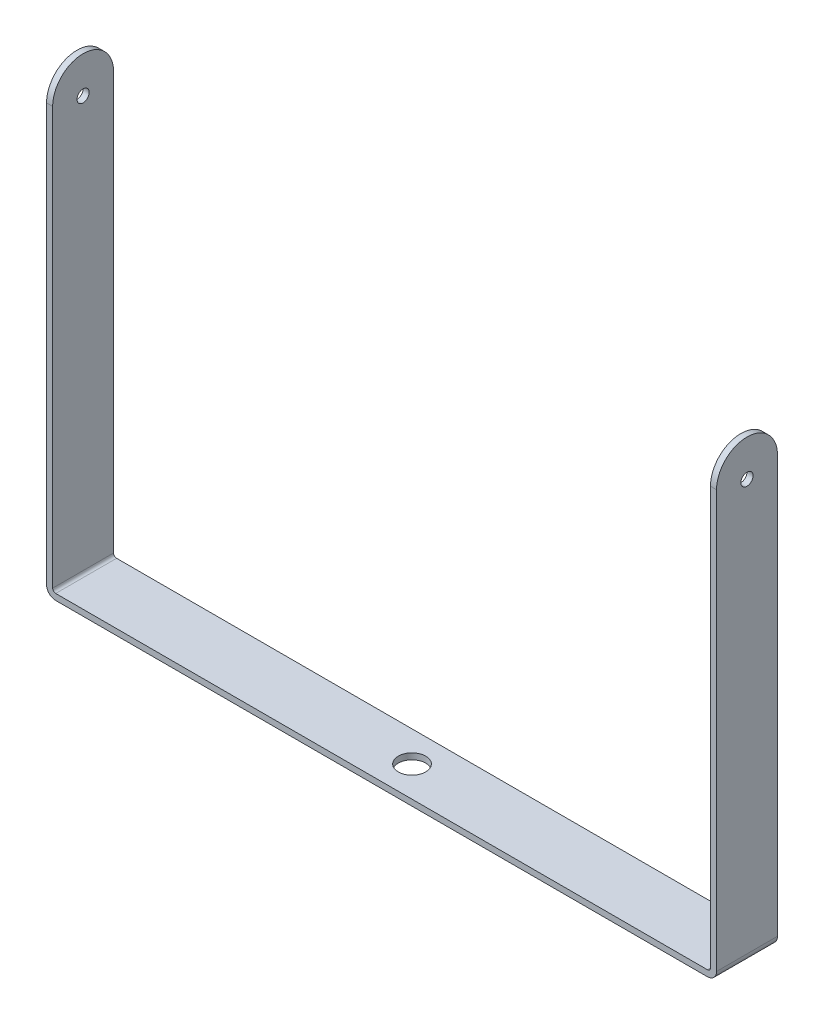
from build123d import *

# Parameters (mm, degrees)
EXTRUSION1_DEPTH        = 10
ESQUISSE2_R             = 4.5
ENL_V_MAT_EXTRU_1_DEPTH = 177.759723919
EXTRUSION2_DEPTH        = 2
ESQUISSE4_R             = 2
ENL_V_MAT_EXTRU_2_DEPTH = 260.89228538


with BuildPart() as part:
    # Esquisse1 → Extrusion1 (new, symmetric)
    with BuildSketch(Plane.XY):
        with BuildLine():
            Line((-110, 2), (-110, -135))
            ThreePointArc((-110, -135), (-109.121320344, -137.121320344), (-107, -138))
            Line((-107, -138), (107, -138))
            ThreePointArc((107, -138), (109.121320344, -137.121320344), (110, -135))
            Line((110, -135), (110, 2))
            Line((110, 2), (108, 2))
            Line((108, 2), (108, -135))
            ThreePointArc((108, -135), (107.707106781, -135.707106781), (107, -136))
            Line((107, -136), (-107, -136))
            ThreePointArc((-107, -136), (-107.707106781, -135.707106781), (-108, -135))
            Line((-108, -135), (-108, 2))
            Line((-108, 2), (-110, 2))
        make_face()
    extrude(amount=EXTRUSION1_DEPTH, both=True)

    # Esquisse2 → Enl_v. mat.-Extru.1 (cut, through all)
    with BuildSketch(Plane(origin=(0, -136, 0), x_dir=(-1, 0, 0), z_dir=(0, 1, 0))):
        with Locations(Location((0, 0, 0), (0, 0, 90))):
            Circle(ESQUISSE2_R)
    extrude(amount=-ENL_V_MAT_EXTRU_1_DEPTH, mode=Mode.SUBTRACT)

    # Esquisse3 → Extrusion2 (add)
    with BuildSketch(Plane(origin=(110, 0, 0), x_dir=(0, 0, -1), z_dir=(1, 0, 0))):
        with BuildLine():
            Line((-10, 2), (10, 2))
            ThreePointArc((10, 2), (0, 12), (-10, 2))
        make_face()
    extrusion2 = extrude(amount=-EXTRUSION2_DEPTH)

    # Sym_trie1: Extrusion2 across plane
    add(extrusion2.mirror(Plane(origin=(0, 0, 0), x_dir=(0, 0, 1), z_dir=(1, 0, 0))))

    # Esquisse4 → Enl_v. mat.-Extru.2 (cut, through all)
    with BuildSketch(Plane.ZY.offset(110)):
        with Locations(Location((0, 0, 0), (0, 0, 270))):
            Circle(ESQUISSE4_R)
    extrude(amount=-ENL_V_MAT_EXTRU_2_DEPTH, mode=Mode.SUBTRACT)


solid = part.part
